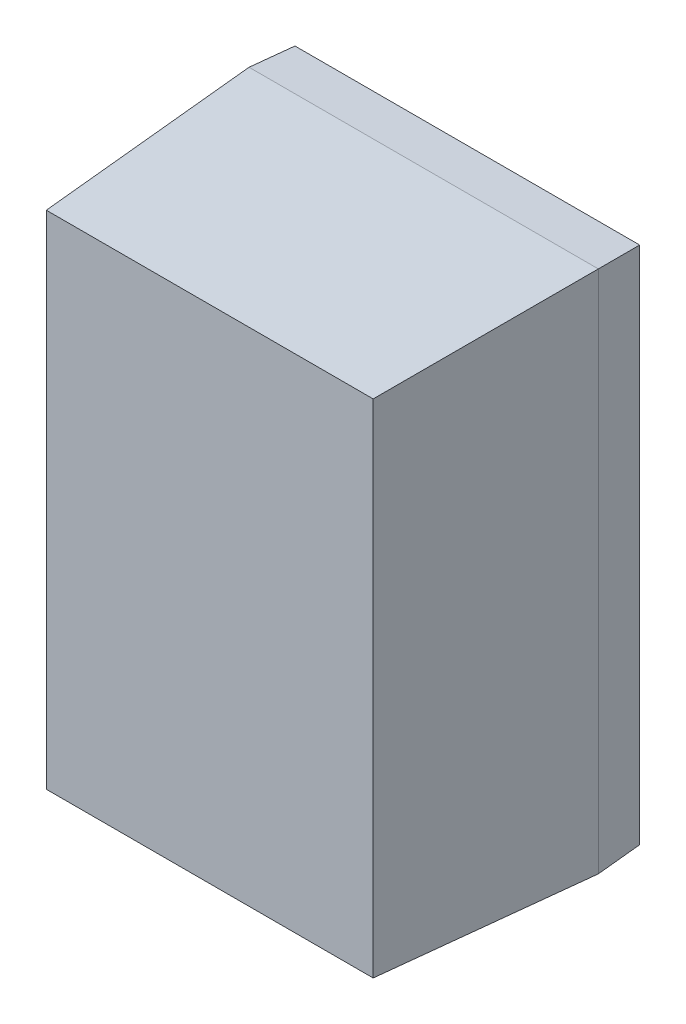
ISO-10303-21;
HEADER;
FILE_DESCRIPTION(('STEP AP214'),'2;1');
FILE_NAME('part.step','',(''),(''),'','','');
FILE_SCHEMA(('AUTOMOTIVE_DESIGN { 1 0 10303 214 1 1 1 1 }'));
ENDSEC;
DATA;
#1=APPLICATION_CONTEXT('core data for automotive mechanical design processes');
#2=APPLICATION_PROTOCOL_DEFINITION('international standard','automotive_design',2000,#1);
#3=PRODUCT_CONTEXT('',#1,'mechanical');
#4=PRODUCT('Part','Part','',(#3));
#5=PRODUCT_RELATED_PRODUCT_CATEGORY('part','',(#4));
#6=PRODUCT_DEFINITION_FORMATION('','',#4);
#7=PRODUCT_DEFINITION_CONTEXT('part definition',#1,'design');
#8=PRODUCT_DEFINITION('design','',#6,#7);
#9=PRODUCT_DEFINITION_SHAPE('','',#8);
#10=(LENGTH_UNIT() NAMED_UNIT(*) SI_UNIT(.MILLI.,.METRE.));
#11=(NAMED_UNIT(*) PLANE_ANGLE_UNIT() SI_UNIT($,.RADIAN.));
#12=(NAMED_UNIT(*) SI_UNIT($,.STERADIAN.) SOLID_ANGLE_UNIT());
#13=UNCERTAINTY_MEASURE_WITH_UNIT(LENGTH_MEASURE(1.E-05),#10,'distance_accuracy_value','');
#14=(GEOMETRIC_REPRESENTATION_CONTEXT(3) GLOBAL_UNCERTAINTY_ASSIGNED_CONTEXT((#13)) GLOBAL_UNIT_ASSIGNED_CONTEXT((#10,
#11,#12)) REPRESENTATION_CONTEXT('',''));
#15=CARTESIAN_POINT('',(0.,0.,0.));
#16=DIRECTION('',(0.,0.,1.));
#17=DIRECTION('',(1.,0.,0.));
#18=AXIS2_PLACEMENT_3D('',#15,#16,#17);
#19=CARTESIAN_POINT('',(-0.4,0.6,0.));
#20=DIRECTION('',(0.,0.,1.));
#21=DIRECTION('',(1.,0.,0.));
#22=AXIS2_PLACEMENT_3D('',#19,#20,#21);
#23=PLANE('',#22);
#24=DIRECTION('',(-1.,0.,0.));
#25=VECTOR('',#24,1.);
#26=CARTESIAN_POINT('',(-0.4,0.594759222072,0.));
#27=LINE('',#26,#25);
#28=CARTESIAN_POINT('',(0.394759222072,0.594759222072,0.));
#29=VERTEX_POINT('',#28);
#30=CARTESIAN_POINT('',(-0.394759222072,0.594759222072,0.));
#31=VERTEX_POINT('',#30);
#32=EDGE_CURVE('E43',#29,#31,#27,.T.);
#33=ORIENTED_EDGE('',*,*,#32,.F.);
#34=DIRECTION('',(0.,1.,0.));
#35=VECTOR('',#34,1.);
#36=CARTESIAN_POINT('',(0.394759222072,0.6,0.));
#37=LINE('',#36,#35);
#38=CARTESIAN_POINT('',(0.394759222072,-0.594759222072,0.));
#39=VERTEX_POINT('',#38);
#40=EDGE_CURVE('E126',#39,#29,#37,.T.);
#41=ORIENTED_EDGE('',*,*,#40,.F.);
#42=DIRECTION('',(1.,0.,0.));
#43=VECTOR('',#42,1.);
#44=CARTESIAN_POINT('',(-0.4,-0.594759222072,0.));
#45=LINE('',#44,#43);
#46=CARTESIAN_POINT('',(-0.394759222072,-0.594759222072,0.));
#47=VERTEX_POINT('',#46);
#48=EDGE_CURVE('E136',#47,#39,#45,.T.);
#49=ORIENTED_EDGE('',*,*,#48,.F.);
#50=DIRECTION('',(0.,-1.,0.));
#51=VECTOR('',#50,1.);
#52=CARTESIAN_POINT('',(-0.394759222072,0.6,0.));
#53=LINE('',#52,#51);
#54=EDGE_CURVE('E11',#31,#47,#53,.T.);
#55=ORIENTED_EDGE('',*,*,#54,.F.);
#56=EDGE_LOOP('',(#33,#41,#49,#55));
#57=FACE_BOUND('',#56,.T.);
#58=ADVANCED_FACE('F17',(#57),#23,.F.);
#59=CARTESIAN_POINT('',(-0.4,0.6,0.1));
#60=DIRECTION('',(-0.998629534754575,0.,-0.0523359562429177));
#61=DIRECTION('',(-0.0523359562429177,0.,0.998629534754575));
#62=AXIS2_PLACEMENT_3D('',#59,#60,#61);
#63=PLANE('',#62);
#64=ORIENTED_EDGE('',*,*,#54,.T.);
#65=DIRECTION('',(-0.0522644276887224,-0.0522644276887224,0.997264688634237));
#66=VECTOR('',#65,1.);
#67=CARTESIAN_POINT('',(-0.394759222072,-0.594759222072,0.));
#68=LINE('',#67,#66);
#69=CARTESIAN_POINT('',(-0.4,-0.6,0.1));
#70=VERTEX_POINT('',#69);
#71=EDGE_CURVE('E124',#47,#70,#68,.T.);
#72=ORIENTED_EDGE('',*,*,#71,.T.);
#73=DIRECTION('',(0.,1.,0.));
#74=VECTOR('',#73,1.);
#75=CARTESIAN_POINT('',(-0.4,0.6,0.1));
#76=LINE('',#75,#74);
#77=CARTESIAN_POINT('',(-0.4,0.6,0.1));
#78=VERTEX_POINT('',#77);
#79=EDGE_CURVE('E99',#70,#78,#76,.T.);
#80=ORIENTED_EDGE('',*,*,#79,.T.);
#81=DIRECTION('',(0.0522644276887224,-0.0522644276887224,-0.997264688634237));
#82=VECTOR('',#81,1.);
#83=CARTESIAN_POINT('',(-0.4,0.6,0.1));
#84=LINE('',#83,#82);
#85=EDGE_CURVE('E26',#78,#31,#84,.T.);
#86=ORIENTED_EDGE('',*,*,#85,.T.);
#87=EDGE_LOOP('',(#64,#72,#80,#86));
#88=FACE_BOUND('',#87,.T.);
#89=ADVANCED_FACE('F19',(#88),#63,.T.);
#90=CARTESIAN_POINT('',(-0.4,0.6,0.1));
#91=DIRECTION('',(0.,0.998629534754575,-0.0523359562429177));
#92=DIRECTION('',(-1.,0.,0.));
#93=AXIS2_PLACEMENT_3D('',#90,#91,#92);
#94=PLANE('',#93);
#95=ORIENTED_EDGE('',*,*,#32,.T.);
#96=ORIENTED_EDGE('',*,*,#85,.F.);
#97=DIRECTION('',(1.,0.,0.));
#98=VECTOR('',#97,1.);
#99=CARTESIAN_POINT('',(-0.4,0.6,0.1));
#100=LINE('',#99,#98);
#101=CARTESIAN_POINT('',(0.4,0.6,0.1));
#102=VERTEX_POINT('',#101);
#103=EDGE_CURVE('E95',#78,#102,#100,.T.);
#104=ORIENTED_EDGE('',*,*,#103,.T.);
#105=DIRECTION('',(-0.0522644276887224,-0.0522644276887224,-0.997264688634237));
#106=VECTOR('',#105,1.);
#107=CARTESIAN_POINT('',(0.4,0.6,0.1));
#108=LINE('',#107,#106);
#109=EDGE_CURVE('E146',#102,#29,#108,.T.);
#110=ORIENTED_EDGE('',*,*,#109,.T.);
#111=EDGE_LOOP('',(#95,#96,#104,#110));
#112=FACE_BOUND('',#111,.T.);
#113=ADVANCED_FACE('F162',(#112),#94,.T.);
#114=CARTESIAN_POINT('',(0.4,0.6,0.1));
#115=DIRECTION('',(0.998629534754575,0.,-0.0523359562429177));
#116=DIRECTION('',(0.,-1.,0.));
#117=AXIS2_PLACEMENT_3D('',#114,#115,#116);
#118=PLANE('',#117);
#119=ORIENTED_EDGE('',*,*,#40,.T.);
#120=ORIENTED_EDGE('',*,*,#109,.F.);
#121=DIRECTION('',(0.,-1.,0.));
#122=VECTOR('',#121,1.);
#123=CARTESIAN_POINT('',(0.4,0.6,0.1));
#124=LINE('',#123,#122);
#125=CARTESIAN_POINT('',(0.4,-0.6,0.1));
#126=VERTEX_POINT('',#125);
#127=EDGE_CURVE('E135',#102,#126,#124,.T.);
#128=ORIENTED_EDGE('',*,*,#127,.T.);
#129=DIRECTION('',(-0.0522644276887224,0.0522644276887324,-0.997264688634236));
#130=VECTOR('',#129,1.);
#131=CARTESIAN_POINT('',(0.4,-0.6,0.1));
#132=LINE('',#131,#130);
#133=EDGE_CURVE('E127',#126,#39,#132,.T.);
#134=ORIENTED_EDGE('',*,*,#133,.T.);
#135=EDGE_LOOP('',(#119,#120,#128,#134));
#136=FACE_BOUND('',#135,.T.);
#137=ADVANCED_FACE('F165',(#136),#118,.T.);
#138=CARTESIAN_POINT('',(-0.4,-0.6,0.1));
#139=DIRECTION('',(0.,-0.998629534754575,-0.0523359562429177));
#140=DIRECTION('',(0.,0.0523359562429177,-0.998629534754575));
#141=AXIS2_PLACEMENT_3D('',#138,#139,#140);
#142=PLANE('',#141);
#143=ORIENTED_EDGE('',*,*,#48,.T.);
#144=ORIENTED_EDGE('',*,*,#133,.F.);
#145=DIRECTION('',(-1.,0.,0.));
#146=VECTOR('',#145,1.);
#147=CARTESIAN_POINT('',(-0.4,-0.6,0.1));
#148=LINE('',#147,#146);
#149=EDGE_CURVE('E131',#126,#70,#148,.T.);
#150=ORIENTED_EDGE('',*,*,#149,.T.);
#151=ORIENTED_EDGE('',*,*,#71,.F.);
#152=EDGE_LOOP('',(#143,#144,#150,#151));
#153=FACE_BOUND('',#152,.T.);
#154=ADVANCED_FACE('F167',(#153),#142,.T.);
#155=CARTESIAN_POINT('',(-0.4,0.6,0.1));
#156=DIRECTION('',(-0.998629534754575,0.,0.0523359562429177));
#157=DIRECTION('',(0.,1.,0.));
#158=AXIS2_PLACEMENT_3D('',#155,#156,#157);
#159=PLANE('',#158);
#160=DIRECTION('',(0.0522644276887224,0.0522644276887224,0.997264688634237));
#161=VECTOR('',#160,1.);
#162=CARTESIAN_POINT('',(-0.4,-0.6,0.1));
#163=LINE('',#162,#161);
#164=CARTESIAN_POINT('',(-0.374320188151,-0.574320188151,0.59));
#165=VERTEX_POINT('',#164);
#166=EDGE_CURVE('E105',#70,#165,#163,.T.);
#167=ORIENTED_EDGE('',*,*,#166,.T.);
#168=DIRECTION('',(0.,1.,0.));
#169=VECTOR('',#168,1.);
#170=CARTESIAN_POINT('',(-0.374320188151,0.6,0.59));
#171=LINE('',#170,#169);
#172=CARTESIAN_POINT('',(-0.374320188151,0.574320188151,0.59));
#173=VERTEX_POINT('',#172);
#174=EDGE_CURVE('E102',#165,#173,#171,.T.);
#175=ORIENTED_EDGE('',*,*,#174,.T.);
#176=DIRECTION('',(-0.0522644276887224,0.0522644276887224,-0.997264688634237));
#177=VECTOR('',#176,1.);
#178=CARTESIAN_POINT('',(-0.374320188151,0.574320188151,0.59));
#179=LINE('',#178,#177);
#180=EDGE_CURVE('E87',#173,#78,#179,.T.);
#181=ORIENTED_EDGE('',*,*,#180,.T.);
#182=ORIENTED_EDGE('',*,*,#79,.F.);
#183=EDGE_LOOP('',(#167,#175,#181,#182));
#184=FACE_BOUND('',#183,.T.);
#185=ADVANCED_FACE('F103',(#184),#159,.T.);
#186=CARTESIAN_POINT('',(-0.4,0.6,0.1));
#187=DIRECTION('',(0.,0.998629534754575,0.0523359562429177));
#188=DIRECTION('',(1.,0.,0.));
#189=AXIS2_PLACEMENT_3D('',#186,#187,#188);
#190=PLANE('',#189);
#191=DIRECTION('',(1.,0.,0.));
#192=VECTOR('',#191,1.);
#193=CARTESIAN_POINT('',(-0.4,0.574320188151,0.59));
#194=LINE('',#193,#192);
#195=CARTESIAN_POINT('',(0.374320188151,0.574320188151,0.59));
#196=VERTEX_POINT('',#195);
#197=EDGE_CURVE('E92',#173,#196,#194,.T.);
#198=ORIENTED_EDGE('',*,*,#197,.T.);
#199=DIRECTION('',(0.0522644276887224,0.0522644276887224,-0.997264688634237));
#200=VECTOR('',#199,1.);
#201=CARTESIAN_POINT('',(0.374320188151,0.574320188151,0.59));
#202=LINE('',#201,#200);
#203=EDGE_CURVE('E132',#196,#102,#202,.T.);
#204=ORIENTED_EDGE('',*,*,#203,.T.);
#205=ORIENTED_EDGE('',*,*,#103,.F.);
#206=ORIENTED_EDGE('',*,*,#180,.F.);
#207=EDGE_LOOP('',(#198,#204,#205,#206));
#208=FACE_BOUND('',#207,.T.);
#209=ADVANCED_FACE('F89',(#208),#190,.T.);
#210=CARTESIAN_POINT('',(0.4,0.6,0.1));
#211=DIRECTION('',(0.998629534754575,0.,0.0523359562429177));
#212=DIRECTION('',(0.,-1.,0.));
#213=AXIS2_PLACEMENT_3D('',#210,#211,#212);
#214=PLANE('',#213);
#215=ORIENTED_EDGE('',*,*,#127,.F.);
#216=ORIENTED_EDGE('',*,*,#203,.F.);
#217=DIRECTION('',(0.,-1.,0.));
#218=VECTOR('',#217,1.);
#219=CARTESIAN_POINT('',(0.374320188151,0.6,0.59));
#220=LINE('',#219,#218);
#221=CARTESIAN_POINT('',(0.374320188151,-0.574320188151,0.59));
#222=VERTEX_POINT('',#221);
#223=EDGE_CURVE('E113',#196,#222,#220,.T.);
#224=ORIENTED_EDGE('',*,*,#223,.T.);
#225=DIRECTION('',(0.0522644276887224,-0.0522644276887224,-0.997264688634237));
#226=VECTOR('',#225,1.);
#227=CARTESIAN_POINT('',(0.374320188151,-0.574320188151,0.59));
#228=LINE('',#227,#226);
#229=EDGE_CURVE('E143',#222,#126,#228,.T.);
#230=ORIENTED_EDGE('',*,*,#229,.T.);
#231=EDGE_LOOP('',(#215,#216,#224,#230));
#232=FACE_BOUND('',#231,.T.);
#233=ADVANCED_FACE('F264',(#232),#214,.T.);
#234=CARTESIAN_POINT('',(-0.4,-0.6,0.1));
#235=DIRECTION('',(0.,-0.998629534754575,0.0523359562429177));
#236=DIRECTION('',(-1.,0.,0.));
#237=AXIS2_PLACEMENT_3D('',#234,#235,#236);
#238=PLANE('',#237);
#239=DIRECTION('',(-1.,0.,0.));
#240=VECTOR('',#239,1.);
#241=CARTESIAN_POINT('',(-0.4,-0.574320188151,0.59));
#242=LINE('',#241,#240);
#243=EDGE_CURVE('E120',#222,#165,#242,.T.);
#244=ORIENTED_EDGE('',*,*,#243,.T.);
#245=ORIENTED_EDGE('',*,*,#166,.F.);
#246=ORIENTED_EDGE('',*,*,#149,.F.);
#247=ORIENTED_EDGE('',*,*,#229,.F.);
#248=EDGE_LOOP('',(#244,#245,#246,#247));
#249=FACE_BOUND('',#248,.T.);
#250=ADVANCED_FACE('F173',(#249),#238,.T.);
#251=CARTESIAN_POINT('',(-0.4,0.6,0.59));
#252=DIRECTION('',(0.,0.,1.));
#253=DIRECTION('',(1.,0.,0.));
#254=AXIS2_PLACEMENT_3D('',#251,#252,#253);
#255=PLANE('',#254);
#256=ORIENTED_EDGE('',*,*,#243,.F.);
#257=ORIENTED_EDGE('',*,*,#223,.F.);
#258=ORIENTED_EDGE('',*,*,#197,.F.);
#259=ORIENTED_EDGE('',*,*,#174,.F.);
#260=EDGE_LOOP('',(#256,#257,#258,#259));
#261=FACE_BOUND('',#260,.T.);
#262=ADVANCED_FACE('F111',(#261),#255,.T.);
#263=CLOSED_SHELL('',(#58,#89,#113,#137,#154,#185,#209,#233,#250,#262));
#264=MANIFOLD_SOLID_BREP('B1',#263);
#265=ADVANCED_BREP_SHAPE_REPRESENTATION('',(#18,#264),#14);
#266=SHAPE_DEFINITION_REPRESENTATION(#9,#265);
ENDSEC;
END-ISO-10303-21;
